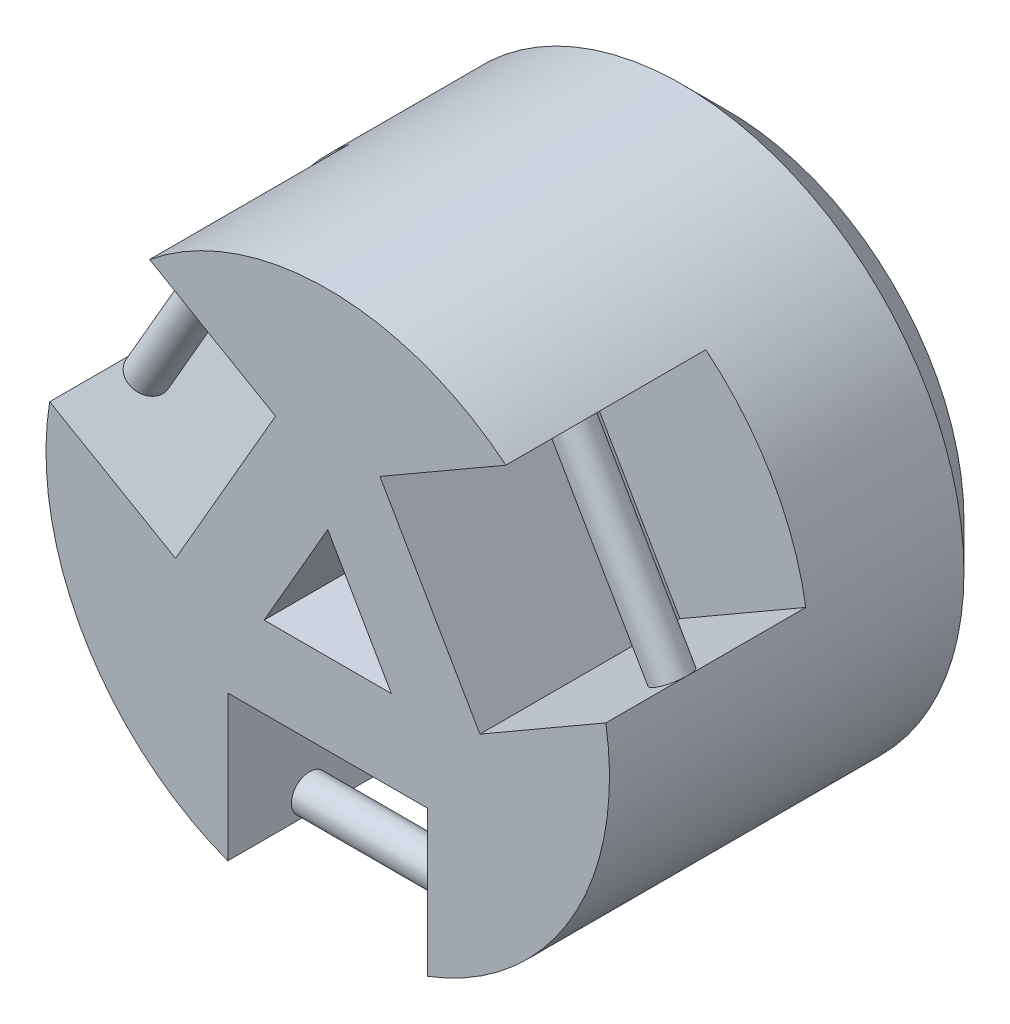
from build123d import *

# Parameters (mm, degrees)
ESQUISSE1_R                  = 15.5
BOSS_EXTRU_1_DEPTH           = 22
CHANFREIN1_SIZE              = 2.5
ESQUISSE2_R                  = 3
BOSS_EXTRU_2_DEPTH           = 5
CHANFREIN2_SIZE              = 1
ENL_V_START                  = -11
ENL_V_MAT_EXTRU_1_DEPTH      = 11
R_P_TITION_CIRCULAIRE1_COUNT = 3
ENL_V_MAT_EXTRU_2_DEPTH      = 21
ESQUISSE5_R                  = 1
BOSS_EXTRU_4_DEPTH           = 5.5
R_P_TITION_CIRCULAIRE2_COUNT = 3


with BuildPart() as part:
    # Esquisse1 → Boss.-Extru.1 (new body)
    with BuildSketch(Plane.XY):
        Circle(ESQUISSE1_R)
    extrude(amount=BOSS_EXTRU_1_DEPTH)

    # Chanfrein1
    chanfrein1_edges = [part.edges().sort_by_distance(p)[0] for p in [
        (-15.5, 0, 0),
    ]]
    chamfer(chanfrein1_edges, length=CHANFREIN1_SIZE)

    # Esquisse2 → Boss.-Extru.2 (add)
    with BuildSketch(Plane(origin=(0, 0, 0), x_dir=(-1, 0, 0), z_dir=(0, 0, -1))):
        with Locations(Location((0, 0, 0), (0, 0, 180))):
            Circle(ESQUISSE2_R)
    extrude(amount=BOSS_EXTRU_2_DEPTH)

    # Chanfrein2
    chanfrein2_edges = [part.edges().sort_by_distance(p)[0] for p in [
        (-3, 0, -5),
    ]]
    chamfer(chanfrein2_edges, length=CHANFREIN2_SIZE)

    # Esquisse3 → Enl_v. mat.-Extru.1 (cut)
    with BuildSketch(Plane.XY.offset(22).offset(ENL_V_START)):
        with BuildLine():
            Line((-5.5, -6.491376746), (5.5, -6.491376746))
            Line((5.5, -6.491376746), (5.5, -14.491376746))
            ThreePointArc((5.5, -14.491376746), (0, -15.5), (-5.5, -14.491376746))
            Line((-5.5, -14.491376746), (-5.5, -6.491376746))
        make_face()
    enl_v_mat_extru_1 = extrude(amount=ENL_V_MAT_EXTRU_1_DEPTH, mode=Mode.SUBTRACT)

    # R_p_tition circulaire1: Enl_v. mat.-Extru.1 ×3 about axis
    r_p_tition_circulaire1_axis = Axis((0, 0, 0), (0, 0, 1))
    for i in range(1, R_P_TITION_CIRCULAIRE1_COUNT):
        add(enl_v_mat_extru_1.rotate(r_p_tition_circulaire1_axis, i * 360 / R_P_TITION_CIRCULAIRE1_COUNT), mode=Mode.SUBTRACT)

    # Esquisse4 → Enl_v. mat.-Extru.2 (cut)
    with BuildSketch(Plane.XY.offset(22)):
        Polygon((-3.5, -2.020725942), (0, 4.041451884), (3.5, -2.020725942), align=None)
    extrude(amount=-ENL_V_MAT_EXTRU_2_DEPTH, mode=Mode.SUBTRACT)

    # Esquisse5 → Boss.-Extru.4 (add, symmetric)
    with BuildSketch(Plane(origin=(0, 0, 0), x_dir=(0, 0, -1), z_dir=(1, 0, 0))):
        with Locations(Location((-17.5, -13.491376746, 0), (0, 0, 270))):
            Circle(ESQUISSE5_R)
    boss_extru_4 = extrude(amount=BOSS_EXTRU_4_DEPTH, both=True)

    # R_p_tition circulaire2: Boss.-Extru.4 ×3 about axis
    r_p_tition_circulaire2_axis = Axis((0, 0, -5), (0, 0, 1))
    for i in range(1, R_P_TITION_CIRCULAIRE2_COUNT):
        add(boss_extru_4.rotate(r_p_tition_circulaire2_axis, i * 360 / R_P_TITION_CIRCULAIRE2_COUNT))


solid = part.part
